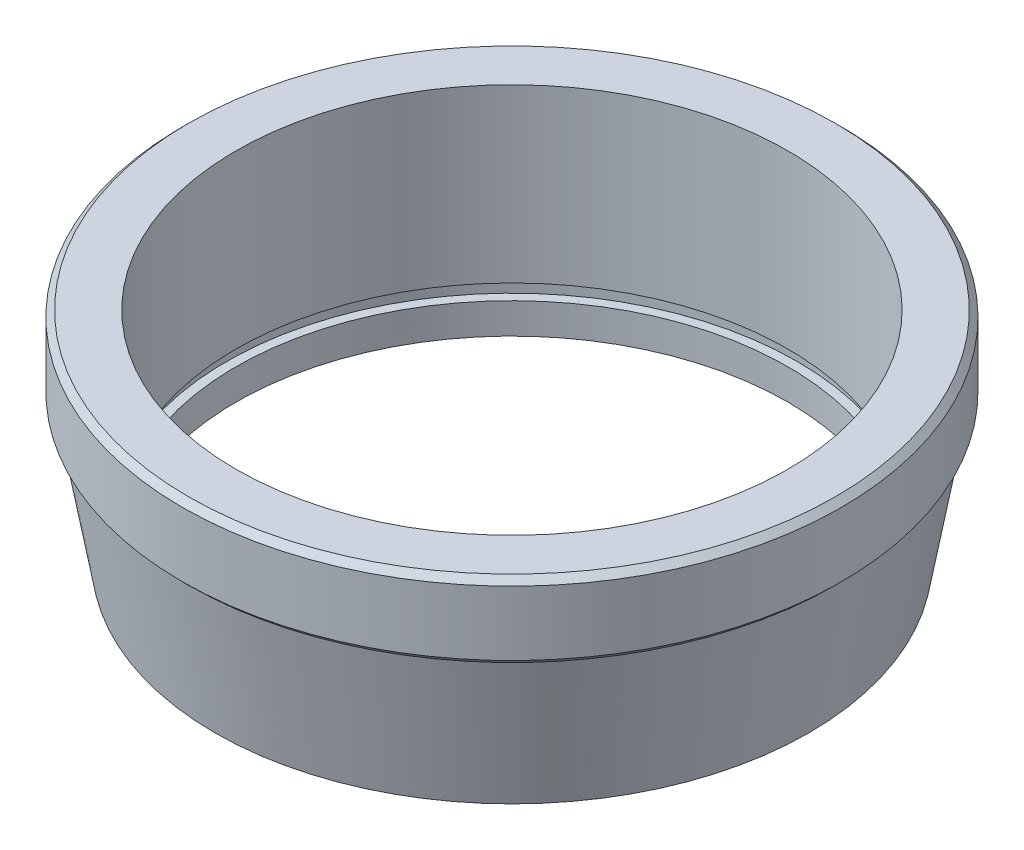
ISO-10303-21;
HEADER;
FILE_DESCRIPTION(('STEP AP214'),'2;1');
FILE_NAME('part.step','',(''),(''),'','','');
FILE_SCHEMA(('AUTOMOTIVE_DESIGN { 1 0 10303 214 1 1 1 1 }'));
ENDSEC;
DATA;
#1=APPLICATION_CONTEXT('core data for automotive mechanical design processes');
#2=APPLICATION_PROTOCOL_DEFINITION('international standard','automotive_design',2000,#1);
#3=PRODUCT_CONTEXT('',#1,'mechanical');
#4=PRODUCT('Part','Part','',(#3));
#5=PRODUCT_RELATED_PRODUCT_CATEGORY('part','',(#4));
#6=PRODUCT_DEFINITION_FORMATION('','',#4);
#7=PRODUCT_DEFINITION_CONTEXT('part definition',#1,'design');
#8=PRODUCT_DEFINITION('design','',#6,#7);
#9=PRODUCT_DEFINITION_SHAPE('','',#8);
#10=(LENGTH_UNIT() NAMED_UNIT(*) SI_UNIT(.MILLI.,.METRE.));
#11=(NAMED_UNIT(*) PLANE_ANGLE_UNIT() SI_UNIT($,.RADIAN.));
#12=(NAMED_UNIT(*) SI_UNIT($,.STERADIAN.) SOLID_ANGLE_UNIT());
#13=UNCERTAINTY_MEASURE_WITH_UNIT(LENGTH_MEASURE(1.E-05),#10,'distance_accuracy_value','');
#14=(GEOMETRIC_REPRESENTATION_CONTEXT(3) GLOBAL_UNCERTAINTY_ASSIGNED_CONTEXT((#13)) GLOBAL_UNIT_ASSIGNED_CONTEXT((#10,
#11,#12)) REPRESENTATION_CONTEXT('',''));
#15=CARTESIAN_POINT('',(0.,0.,0.));
#16=DIRECTION('',(0.,0.,1.));
#17=DIRECTION('',(1.,0.,0.));
#18=AXIS2_PLACEMENT_3D('',#15,#16,#17);
#19=CARTESIAN_POINT('',(0.,0.,0.));
#20=DIRECTION('',(0.,1.,0.));
#21=DIRECTION('',(0.,0.,1.));
#22=AXIS2_PLACEMENT_3D('',#19,#20,#21);
#23=CYLINDRICAL_SURFACE('',#22,9.);
#24=CARTESIAN_POINT('',(0.,-3.1,0.));
#25=DIRECTION('',(0.,1.,0.));
#26=DIRECTION('',(0.,0.,1.));
#27=AXIS2_PLACEMENT_3D('',#24,#25,#26);
#28=CIRCLE('',#27,9.);
#29=CARTESIAN_POINT('',(0.,-3.1,9.));
#30=VERTEX_POINT('',#29);
#31=EDGE_CURVE('E66',#30,#30,#28,.T.);
#32=ORIENTED_EDGE('',*,*,#31,.F.);
#33=EDGE_LOOP('',(#32));
#34=FACE_BOUND('',#33,.T.);
#35=CARTESIAN_POINT('',(0.,2.5,0.));
#36=DIRECTION('',(0.,1.,0.));
#37=DIRECTION('',(0.,0.,1.));
#38=AXIS2_PLACEMENT_3D('',#35,#36,#37);
#39=CIRCLE('',#38,9.);
#40=CARTESIAN_POINT('',(0.,2.5,9.));
#41=VERTEX_POINT('',#40);
#42=EDGE_CURVE('E57',#41,#41,#39,.T.);
#43=ORIENTED_EDGE('',*,*,#42,.T.);
#44=EDGE_LOOP('',(#43));
#45=FACE_BOUND('',#44,.T.);
#46=ADVANCED_FACE('F31',(#34,#45),#23,.F.);
#47=CARTESIAN_POINT('',(0.,0.,0.));
#48=DIRECTION('',(0.,1.,0.));
#49=DIRECTION('',(0.,0.,1.));
#50=AXIS2_PLACEMENT_3D('',#47,#48,#49);
#51=CONICAL_SURFACE('',#50,10.5,0.174532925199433);
#52=CARTESIAN_POINT('',(0.,-4.6,0.));
#53=DIRECTION('',(0.,1.,0.));
#54=DIRECTION('',(0.,0.,1.));
#55=AXIS2_PLACEMENT_3D('',#52,#53,#54);
#56=CIRCLE('',#55,9.68889588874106);
#57=CARTESIAN_POINT('',(0.,-4.6,9.68889588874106));
#58=VERTEX_POINT('',#57);
#59=EDGE_CURVE('E51',#58,#58,#56,.T.);
#60=ORIENTED_EDGE('',*,*,#59,.T.);
#61=EDGE_LOOP('',(#60));
#62=FACE_BOUND('',#61,.T.);
#63=CARTESIAN_POINT('',(0.,0.,0.));
#64=DIRECTION('',(0.,1.,0.));
#65=DIRECTION('',(0.,0.,1.));
#66=AXIS2_PLACEMENT_3D('',#63,#64,#65);
#67=CIRCLE('',#66,10.5);
#68=CARTESIAN_POINT('',(0.,0.,10.5));
#69=VERTEX_POINT('',#68);
#70=EDGE_CURVE('E54',#69,#69,#67,.T.);
#71=ORIENTED_EDGE('',*,*,#70,.F.);
#72=EDGE_LOOP('',(#71));
#73=FACE_BOUND('',#72,.T.);
#74=ADVANCED_FACE('F93',(#62,#73),#51,.T.);
#75=CARTESIAN_POINT('',(0.,-4.6,0.));
#76=DIRECTION('',(0.,1.,0.));
#77=DIRECTION('',(0.,0.,1.));
#78=AXIS2_PLACEMENT_3D('',#75,#76,#77);
#79=PLANE('',#78);
#80=CARTESIAN_POINT('',(0.,-4.6,0.));
#81=DIRECTION('',(0.,-1.,0.));
#82=DIRECTION('',(0.,0.,-1.));
#83=AXIS2_PLACEMENT_3D('',#80,#81,#82);
#84=CIRCLE('',#83,9.);
#85=CARTESIAN_POINT('',(0.,-4.6,-9.));
#86=VERTEX_POINT('',#85);
#87=EDGE_CURVE('E60',#86,#86,#84,.T.);
#88=ORIENTED_EDGE('',*,*,#87,.F.);
#89=EDGE_LOOP('',(#88));
#90=FACE_BOUND('',#89,.T.);
#91=ORIENTED_EDGE('',*,*,#59,.F.);
#92=EDGE_LOOP('',(#91));
#93=FACE_BOUND('',#92,.T.);
#94=ADVANCED_FACE('F108',(#90,#93),#79,.F.);
#95=CARTESIAN_POINT('',(0.,2.5,0.));
#96=DIRECTION('',(0.,-1.,0.));
#97=DIRECTION('',(0.,0.,-1.));
#98=AXIS2_PLACEMENT_3D('',#95,#96,#97);
#99=CYLINDRICAL_SURFACE('',#98,10.75);
#100=CARTESIAN_POINT('',(0.,0.200000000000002,0.));
#101=DIRECTION('',(0.,1.,0.));
#102=DIRECTION('',(0.,0.,1.));
#103=AXIS2_PLACEMENT_3D('',#100,#101,#102);
#104=CIRCLE('',#103,10.75);
#105=CARTESIAN_POINT('',(0.,0.200000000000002,10.75));
#106=VERTEX_POINT('',#105);
#107=EDGE_CURVE('E42',#106,#106,#104,.T.);
#108=ORIENTED_EDGE('',*,*,#107,.T.);
#109=EDGE_LOOP('',(#108));
#110=FACE_BOUND('',#109,.T.);
#111=CARTESIAN_POINT('',(0.,2.3,0.));
#112=DIRECTION('',(0.,1.,0.));
#113=DIRECTION('',(0.,0.,1.));
#114=AXIS2_PLACEMENT_3D('',#111,#112,#113);
#115=CIRCLE('',#114,10.75);
#116=CARTESIAN_POINT('',(0.,2.3,10.75));
#117=VERTEX_POINT('',#116);
#118=EDGE_CURVE('E46',#117,#117,#115,.F.);
#119=ORIENTED_EDGE('',*,*,#118,.T.);
#120=EDGE_LOOP('',(#119));
#121=FACE_BOUND('',#120,.T.);
#122=ADVANCED_FACE('F100',(#110,#121),#99,.T.);
#123=CARTESIAN_POINT('',(0.,2.5,0.));
#124=DIRECTION('',(0.,1.,0.));
#125=DIRECTION('',(0.,0.,1.));
#126=AXIS2_PLACEMENT_3D('',#123,#124,#125);
#127=PLANE('',#126);
#128=ORIENTED_EDGE('',*,*,#42,.F.);
#129=EDGE_LOOP('',(#128));
#130=FACE_BOUND('',#129,.T.);
#131=CARTESIAN_POINT('',(0.,2.5,0.));
#132=DIRECTION('',(0.,1.,0.));
#133=DIRECTION('',(0.,0.,1.));
#134=AXIS2_PLACEMENT_3D('',#131,#132,#133);
#135=CIRCLE('',#134,10.55);
#136=CARTESIAN_POINT('',(0.,2.5,10.55));
#137=VERTEX_POINT('',#136);
#138=EDGE_CURVE('E10',#137,#137,#135,.T.);
#139=ORIENTED_EDGE('',*,*,#138,.T.);
#140=EDGE_LOOP('',(#139));
#141=FACE_BOUND('',#140,.T.);
#142=ADVANCED_FACE('F97',(#130,#141),#127,.T.);
#143=CARTESIAN_POINT('',(0.,0.,0.));
#144=DIRECTION('',(0.,1.,0.));
#145=DIRECTION('',(0.,0.,1.));
#146=AXIS2_PLACEMENT_3D('',#143,#144,#145);
#147=PLANE('',#146);
#148=CARTESIAN_POINT('',(0.,0.,0.));
#149=DIRECTION('',(0.,1.,0.));
#150=DIRECTION('',(0.,0.,1.));
#151=AXIS2_PLACEMENT_3D('',#148,#149,#150);
#152=CIRCLE('',#151,10.55);
#153=CARTESIAN_POINT('',(0.,0.,10.55));
#154=VERTEX_POINT('',#153);
#155=EDGE_CURVE('E38',#154,#154,#152,.F.);
#156=ORIENTED_EDGE('',*,*,#155,.T.);
#157=EDGE_LOOP('',(#156));
#158=FACE_BOUND('',#157,.T.);
#159=ORIENTED_EDGE('',*,*,#70,.T.);
#160=EDGE_LOOP('',(#159));
#161=FACE_BOUND('',#160,.T.);
#162=ADVANCED_FACE('F99',(#158,#161),#147,.F.);
#163=CARTESIAN_POINT('',(0.,0.200000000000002,0.));
#164=DIRECTION('',(0.,1.,0.));
#165=DIRECTION('',(0.,0.,1.));
#166=AXIS2_PLACEMENT_3D('',#163,#164,#165);
#167=CONICAL_SURFACE('',#166,10.75,0.785398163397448);
#168=ORIENTED_EDGE('',*,*,#155,.F.);
#169=EDGE_LOOP('',(#168));
#170=FACE_BOUND('',#169,.T.);
#171=ORIENTED_EDGE('',*,*,#107,.F.);
#172=EDGE_LOOP('',(#171));
#173=FACE_BOUND('',#172,.T.);
#174=ADVANCED_FACE('F106',(#170,#173),#167,.T.);
#175=CARTESIAN_POINT('',(0.,2.5,0.));
#176=DIRECTION('',(0.,-1.,0.));
#177=DIRECTION('',(0.,0.,-1.));
#178=AXIS2_PLACEMENT_3D('',#175,#176,#177);
#179=CONICAL_SURFACE('',#178,10.55,0.785398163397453);
#180=ORIENTED_EDGE('',*,*,#118,.F.);
#181=EDGE_LOOP('',(#180));
#182=FACE_BOUND('',#181,.T.);
#183=ORIENTED_EDGE('',*,*,#138,.F.);
#184=EDGE_LOOP('',(#183));
#185=FACE_BOUND('',#184,.T.);
#186=ADVANCED_FACE('F33',(#182,#185),#179,.T.);
#187=CARTESIAN_POINT('',(0.,-3.6,0.));
#188=DIRECTION('',(0.,1.,0.));
#189=DIRECTION('',(0.,0.,1.));
#190=AXIS2_PLACEMENT_3D('',#187,#188,#189);
#191=CIRCLE('',#190,9.);
#192=CARTESIAN_POINT('',(0.,-3.6,9.));
#193=VERTEX_POINT('',#192);
#194=EDGE_CURVE('E69',#193,#193,#191,.T.);
#195=ORIENTED_EDGE('',*,*,#194,.T.);
#196=EDGE_LOOP('',(#195));
#197=FACE_BOUND('',#196,.T.);
#198=ORIENTED_EDGE('',*,*,#87,.T.);
#199=EDGE_LOOP('',(#198));
#200=FACE_BOUND('',#199,.T.);
#201=ADVANCED_FACE('F82',(#197,#200),#23,.F.);
#202=CARTESIAN_POINT('',(0.,2.5,0.));
#203=DIRECTION('',(0.,1.,0.));
#204=DIRECTION('',(0.,0.,1.));
#205=AXIS2_PLACEMENT_3D('',#202,#203,#204);
#206=CYLINDRICAL_SURFACE('',#205,9.3);
#207=CARTESIAN_POINT('',(0.,-3.6,0.));
#208=DIRECTION('',(0.,1.,0.));
#209=DIRECTION('',(0.,0.,1.));
#210=AXIS2_PLACEMENT_3D('',#207,#208,#209);
#211=CIRCLE('',#210,9.3);
#212=CARTESIAN_POINT('',(0.,-3.6,9.3));
#213=VERTEX_POINT('',#212);
#214=EDGE_CURVE('E72',#213,#213,#211,.T.);
#215=ORIENTED_EDGE('',*,*,#214,.F.);
#216=EDGE_LOOP('',(#215));
#217=FACE_BOUND('',#216,.T.);
#218=CARTESIAN_POINT('',(0.,-3.1,0.));
#219=DIRECTION('',(0.,1.,0.));
#220=DIRECTION('',(0.,0.,1.));
#221=AXIS2_PLACEMENT_3D('',#218,#219,#220);
#222=CIRCLE('',#221,9.3);
#223=CARTESIAN_POINT('',(0.,-3.1,9.3));
#224=VERTEX_POINT('',#223);
#225=EDGE_CURVE('E63',#224,#224,#222,.T.);
#226=ORIENTED_EDGE('',*,*,#225,.T.);
#227=EDGE_LOOP('',(#226));
#228=FACE_BOUND('',#227,.T.);
#229=ADVANCED_FACE('F78',(#217,#228),#206,.F.);
#230=CARTESIAN_POINT('',(-9.3,-3.1,0.));
#231=DIRECTION('',(0.,1.,0.));
#232=DIRECTION('',(0.,0.,1.));
#233=AXIS2_PLACEMENT_3D('',#230,#231,#232);
#234=PLANE('',#233);
#235=ORIENTED_EDGE('',*,*,#225,.F.);
#236=EDGE_LOOP('',(#235));
#237=FACE_BOUND('',#236,.T.);
#238=ORIENTED_EDGE('',*,*,#31,.T.);
#239=EDGE_LOOP('',(#238));
#240=FACE_BOUND('',#239,.T.);
#241=ADVANCED_FACE('F81',(#237,#240),#234,.F.);
#242=CARTESIAN_POINT('',(-9.3,-3.6,0.));
#243=DIRECTION('',(0.,-1.,0.));
#244=DIRECTION('',(0.,0.,-1.));
#245=AXIS2_PLACEMENT_3D('',#242,#243,#244);
#246=PLANE('',#245);
#247=ORIENTED_EDGE('',*,*,#194,.F.);
#248=EDGE_LOOP('',(#247));
#249=FACE_BOUND('',#248,.T.);
#250=ORIENTED_EDGE('',*,*,#214,.T.);
#251=EDGE_LOOP('',(#250));
#252=FACE_BOUND('',#251,.T.);
#253=ADVANCED_FACE('F76',(#249,#252),#246,.F.);
#254=CLOSED_SHELL('',(#46,#74,#94,#122,#142,#162,#174,#186,#201,#229,#241,#253));
#255=MANIFOLD_SOLID_BREP('B2',#254);
#256=ADVANCED_BREP_SHAPE_REPRESENTATION('',(#18,#255),#14);
#257=SHAPE_DEFINITION_REPRESENTATION(#9,#256);
ENDSEC;
END-ISO-10303-21;
